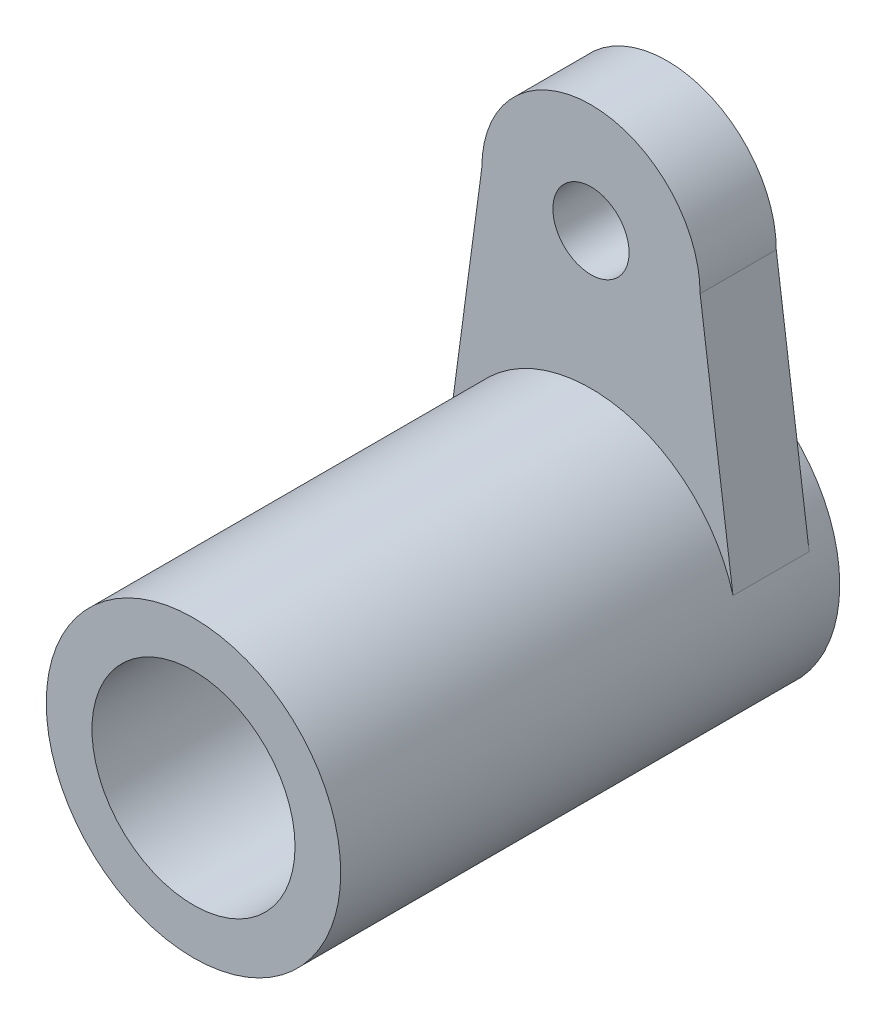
from build123d import *

# Parameters (mm, degrees)
EXTRUDE_1_DEPTH     = 1.5
SKETCH_3_R          = 2.9
EXTRUDE_2_DEPTH     = 3.829
EXTRUDE_START       = 0.5
SKETCH_4_R          = 2.9
EXTRUDE_3_DEPTH     = 0.5
SKETCH_5_R          = 2
CUT_EXTRUDE_1_DEPTH = 3
CUT_EXTRUDE_START   = -0.7
SKETCH_6_R          = 2
CUT_EXTRUDE_2_DEPTH = 0.7
SKETCH_7_R          = 1.1
CUT_EXTRUDE_3_DEPTH = 3.7
SKETCH_8_R          = 0.75
CUT_EXTRUDE_4_DEPTH = 3.7
SKETCH_10_R         = 2.9
SKETCH_10_R_2       = 2
EXTRUDE_4_DEPTH     = 4


with BuildPart() as part:
    # Sketch 1 → Extrude 1 (new body)
    with BuildSketch(Plane.XY):
        with BuildLine():
            Line((-2.15, 0), (-2.797439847, -4.825584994))
            ThreePointArc((-2.797439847, -4.825584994), (0, -8.49), (2.797439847, -4.825584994))
            Line((2.797439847, -4.825584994), (2.15, 0))
            ThreePointArc((2.15, 0), (0, 2.15), (-2.15, 0))
        make_face()
    extrude(amount=EXTRUDE_1_DEPTH)

    # Sketch 3 → Extrude 2 (add)
    with BuildSketch(Plane.XY.offset(1.5)):
        with Locations(Location((0, -5.59, 0), (0, 0, 164.716730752))):
            Circle(SKETCH_3_R)
    extrude(amount=EXTRUDE_2_DEPTH)

    # Sketch 4 → Extrude 3 (add)
    with BuildSketch(Plane(origin=(0, 0, 0), x_dir=(-1, 0, 0), z_dir=(0, 0, -1)).offset(EXTRUDE_START)):
        with Locations((0, -5.59)):
            Circle(SKETCH_4_R)
    extrude(amount=-EXTRUDE_3_DEPTH)

    # Sketch 5 → Cut-Extrude 1 (cut)
    with BuildSketch(Plane.XY.offset(5.329)):
        with Locations((0, -5.59)):
            Circle(SKETCH_5_R)
    extrude(amount=-CUT_EXTRUDE_1_DEPTH, mode=Mode.SUBTRACT)

    # Sketch 6 → Cut-Extrude 2 (cut)
    with BuildSketch(Plane(origin=(0, 0, -0.5), x_dir=(-1, 0, 0), z_dir=(0, 0, -1)).offset(CUT_EXTRUDE_START)):
        with Locations(Location((0, -5.59, 0), (0, 0, 180))):
            Circle(SKETCH_6_R)
    extrude(amount=CUT_EXTRUDE_2_DEPTH, mode=Mode.SUBTRACT)

    # Sketch 7 → Cut-Extrude 3 (cut)
    with BuildSketch(Plane(origin=(0, 0, 0.2), x_dir=(-1, 0, 0), z_dir=(0, 0, -1))):
        with Locations((0, -5.59)):
            Circle(SKETCH_7_R)
    extrude(amount=-CUT_EXTRUDE_3_DEPTH, mode=Mode.SUBTRACT)

    # Sketch 8 → Cut-Extrude 4 (cut)
    with BuildSketch(Plane.XY.offset(1.5)):
        Circle(SKETCH_8_R)
    extrude(amount=-CUT_EXTRUDE_4_DEPTH, mode=Mode.SUBTRACT)

    # Sketch 10 → Extrude 4 (add)
    with BuildSketch(Plane.XY.offset(5.329)):
        with Locations(Location((0, -5.59, 0), (0, 0, 180))):
            Circle(SKETCH_10_R)
        with Locations((0, -5.59)):
            Circle(SKETCH_10_R_2, mode=Mode.SUBTRACT)
    extrude(amount=EXTRUDE_4_DEPTH)


solid = part.part
